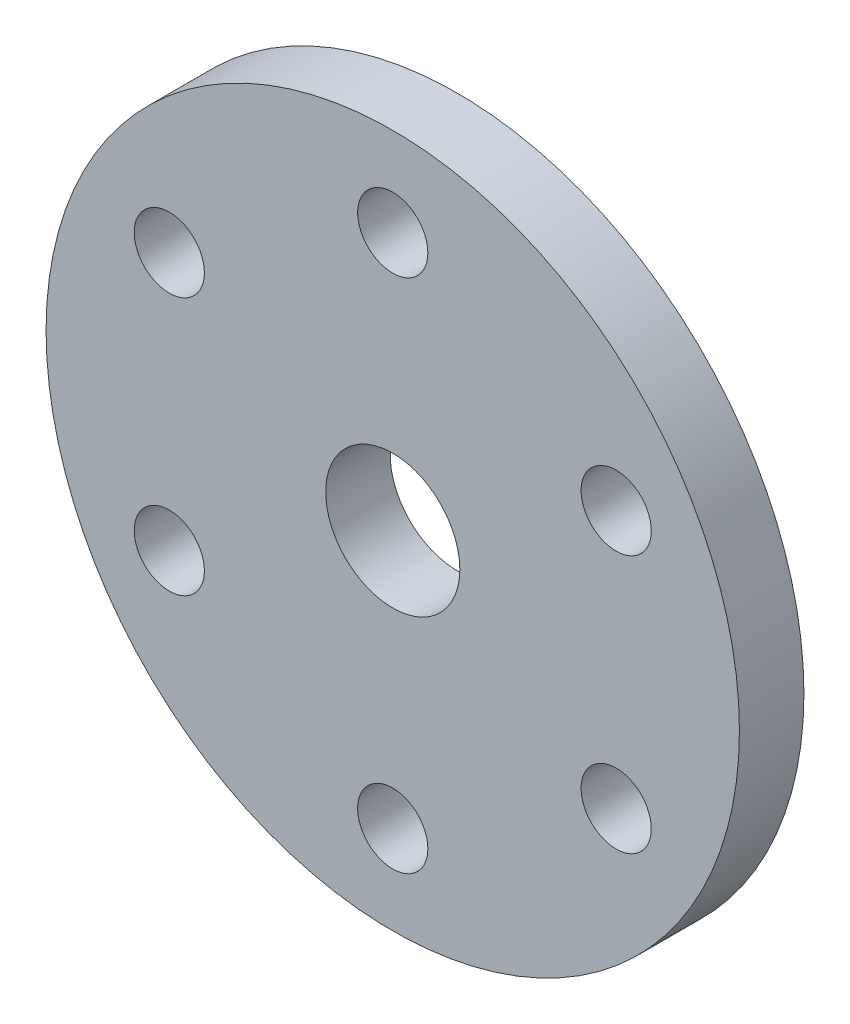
from build123d import *

# Parameters (mm, degrees)
SKETCH1_R                   = 17.065625
SKETCH1_R_2                 = 3.302
EXTRUDE1_DEPTH              = 3.175
F_29_0_136_DIAMETER_HOLE1_D = 3.4544


with BuildPart() as part:
    # Sketch1 → Extrude1 (new body)
    with BuildSketch(Plane.XY):
        Circle(SKETCH1_R)
        Circle(SKETCH1_R_2, mode=Mode.SUBTRACT)
    extrude(amount=EXTRUDE1_DEPTH)

    # 29 _0.136_ Diameter Hole1 (through all)
    with Locations(Plane.XY.offset(3.175)):
        with Locations((0, 12.7), (10.998522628, 6.35), (10.998522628, -6.35), (0, -12.7), (-10.998522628, -6.35), (-10.998522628, 6.35)):
            Hole(F_29_0_136_DIAMETER_HOLE1_D / 2)


solid = part.part
